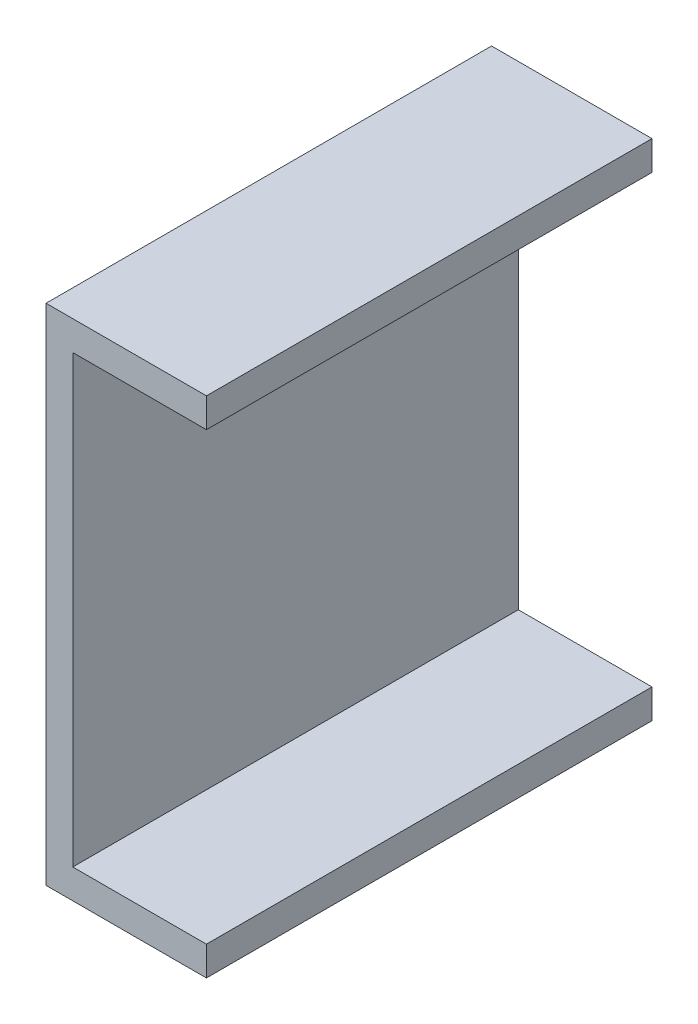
ISO-10303-21;
HEADER;
FILE_DESCRIPTION(('STEP AP214'),'2;1');
FILE_NAME('part.step','',(''),(''),'','','');
FILE_SCHEMA(('AUTOMOTIVE_DESIGN { 1 0 10303 214 1 1 1 1 }'));
ENDSEC;
DATA;
#1=APPLICATION_CONTEXT('core data for automotive mechanical design processes');
#2=APPLICATION_PROTOCOL_DEFINITION('international standard','automotive_design',2000,#1);
#3=PRODUCT_CONTEXT('',#1,'mechanical');
#4=PRODUCT('Part','Part','',(#3));
#5=PRODUCT_RELATED_PRODUCT_CATEGORY('part','',(#4));
#6=PRODUCT_DEFINITION_FORMATION('','',#4);
#7=PRODUCT_DEFINITION_CONTEXT('part definition',#1,'design');
#8=PRODUCT_DEFINITION('design','',#6,#7);
#9=PRODUCT_DEFINITION_SHAPE('','',#8);
#10=(LENGTH_UNIT() NAMED_UNIT(*) SI_UNIT(.MILLI.,.METRE.));
#11=(NAMED_UNIT(*) PLANE_ANGLE_UNIT() SI_UNIT($,.RADIAN.));
#12=(NAMED_UNIT(*) SI_UNIT($,.STERADIAN.) SOLID_ANGLE_UNIT());
#13=UNCERTAINTY_MEASURE_WITH_UNIT(LENGTH_MEASURE(1.E-05),#10,'distance_accuracy_value','');
#14=(GEOMETRIC_REPRESENTATION_CONTEXT(3) GLOBAL_UNCERTAINTY_ASSIGNED_CONTEXT((#13)) GLOBAL_UNIT_ASSIGNED_CONTEXT((#10,
#11,#12)) REPRESENTATION_CONTEXT('',''));
#15=CARTESIAN_POINT('',(0.,0.,0.));
#16=DIRECTION('',(0.,0.,1.));
#17=DIRECTION('',(1.,0.,0.));
#18=AXIS2_PLACEMENT_3D('',#15,#16,#17);
#19=CARTESIAN_POINT('',(101.695580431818,33.8978846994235,50.));
#20=DIRECTION('',(-1.,0.,0.));
#21=DIRECTION('',(0.,0.,1.));
#22=AXIS2_PLACEMENT_3D('',#19,#20,#21);
#23=PLANE('',#22);
#24=DIRECTION('',(0.,1.,0.));
#25=VECTOR('',#24,1.);
#26=CARTESIAN_POINT('',(101.695580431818,33.8978846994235,0.));
#27=LINE('',#26,#25);
#28=CARTESIAN_POINT('',(101.695580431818,30.6082089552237,0.));
#29=VERTEX_POINT('',#28);
#30=CARTESIAN_POINT('',(101.695580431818,33.8978846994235,0.));
#31=VERTEX_POINT('',#30);
#32=EDGE_CURVE('E146',#29,#31,#27,.T.);
#33=ORIENTED_EDGE('',*,*,#32,.T.);
#34=DIRECTION('',(0.,0.,-1.));
#35=VECTOR('',#34,1.);
#36=CARTESIAN_POINT('',(101.695580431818,33.8978846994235,50.));
#37=LINE('',#36,#35);
#38=CARTESIAN_POINT('',(101.695580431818,33.8978846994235,50.));
#39=VERTEX_POINT('',#38);
#40=EDGE_CURVE('E11',#39,#31,#37,.T.);
#41=ORIENTED_EDGE('',*,*,#40,.F.);
#42=DIRECTION('',(0.,1.,0.));
#43=VECTOR('',#42,1.);
#44=CARTESIAN_POINT('',(101.695580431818,33.8978846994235,50.));
#45=LINE('',#44,#43);
#46=CARTESIAN_POINT('',(101.695580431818,30.6082089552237,50.));
#47=VERTEX_POINT('',#46);
#48=EDGE_CURVE('E169',#47,#39,#45,.T.);
#49=ORIENTED_EDGE('',*,*,#48,.F.);
#50=DIRECTION('',(0.,0.,-1.));
#51=VECTOR('',#50,1.);
#52=CARTESIAN_POINT('',(101.695580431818,30.6082089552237,50.));
#53=LINE('',#52,#51);
#54=EDGE_CURVE('E142',#47,#29,#53,.T.);
#55=ORIENTED_EDGE('',*,*,#54,.T.);
#56=EDGE_LOOP('',(#33,#41,#49,#55));
#57=FACE_BOUND('',#56,.T.);
#58=ADVANCED_FACE('F45',(#57),#23,.F.);
#59=CARTESIAN_POINT('',(86.6955804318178,33.8978846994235,50.));
#60=DIRECTION('',(0.,-1.,0.));
#61=DIRECTION('',(1.,0.,0.));
#62=AXIS2_PLACEMENT_3D('',#59,#60,#61);
#63=PLANE('',#62);
#64=DIRECTION('',(-1.,0.,0.));
#65=VECTOR('',#64,1.);
#66=CARTESIAN_POINT('',(86.6955804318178,33.8978846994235,0.));
#67=LINE('',#66,#65);
#68=CARTESIAN_POINT('',(83.6955804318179,33.8978846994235,0.));
#69=VERTEX_POINT('',#68);
#70=EDGE_CURVE('E150',#31,#69,#67,.T.);
#71=ORIENTED_EDGE('',*,*,#70,.T.);
#72=DIRECTION('',(0.,0.,-1.));
#73=VECTOR('',#72,1.);
#74=CARTESIAN_POINT('',(83.6955804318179,33.8978846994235,50.));
#75=LINE('',#74,#73);
#76=CARTESIAN_POINT('',(83.6955804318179,33.8978846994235,50.));
#77=VERTEX_POINT('',#76);
#78=EDGE_CURVE('E54',#77,#69,#75,.T.);
#79=ORIENTED_EDGE('',*,*,#78,.F.);
#80=DIRECTION('',(-1.,0.,0.));
#81=VECTOR('',#80,1.);
#82=CARTESIAN_POINT('',(101.695580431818,33.8978846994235,50.));
#83=LINE('',#82,#81);
#84=EDGE_CURVE('E105',#39,#77,#83,.T.);
#85=ORIENTED_EDGE('',*,*,#84,.F.);
#86=ORIENTED_EDGE('',*,*,#40,.T.);
#87=EDGE_LOOP('',(#71,#79,#85,#86));
#88=FACE_BOUND('',#87,.T.);
#89=ADVANCED_FACE('F214',(#88),#63,.F.);
#90=CARTESIAN_POINT('',(83.6955804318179,33.8978846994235,50.));
#91=DIRECTION('',(1.,0.,0.));
#92=DIRECTION('',(0.,1.,0.));
#93=AXIS2_PLACEMENT_3D('',#90,#91,#92);
#94=PLANE('',#93);
#95=DIRECTION('',(0.,-1.,0.));
#96=VECTOR('',#95,1.);
#97=CARTESIAN_POINT('',(83.6955804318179,33.8978846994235,0.));
#98=LINE('',#97,#96);
#99=CARTESIAN_POINT('',(83.6955804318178,-22.6817910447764,0.));
#100=VERTEX_POINT('',#99);
#101=EDGE_CURVE('E153',#69,#100,#98,.T.);
#102=ORIENTED_EDGE('',*,*,#101,.T.);
#103=DIRECTION('',(0.,0.,-1.));
#104=VECTOR('',#103,1.);
#105=CARTESIAN_POINT('',(83.6955804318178,-22.6817910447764,50.));
#106=LINE('',#105,#104);
#107=CARTESIAN_POINT('',(83.6955804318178,-22.6817910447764,50.));
#108=VERTEX_POINT('',#107);
#109=EDGE_CURVE('E180',#108,#100,#106,.T.);
#110=ORIENTED_EDGE('',*,*,#109,.F.);
#111=DIRECTION('',(0.,-1.,0.));
#112=VECTOR('',#111,1.);
#113=CARTESIAN_POINT('',(83.6955804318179,33.8978846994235,50.));
#114=LINE('',#113,#112);
#115=EDGE_CURVE('E190',#77,#108,#114,.T.);
#116=ORIENTED_EDGE('',*,*,#115,.F.);
#117=ORIENTED_EDGE('',*,*,#78,.T.);
#118=EDGE_LOOP('',(#102,#110,#116,#117));
#119=FACE_BOUND('',#118,.T.);
#120=ADVANCED_FACE('F188',(#119),#94,.F.);
#121=CARTESIAN_POINT('',(101.695580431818,-22.6817910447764,50.));
#122=DIRECTION('',(0.,1.,0.));
#123=DIRECTION('',(0.,0.,1.));
#124=AXIS2_PLACEMENT_3D('',#121,#122,#123);
#125=PLANE('',#124);
#126=DIRECTION('',(1.,0.,0.));
#127=VECTOR('',#126,1.);
#128=CARTESIAN_POINT('',(101.695580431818,-22.6817910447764,0.));
#129=LINE('',#128,#127);
#130=CARTESIAN_POINT('',(101.695580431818,-22.6817910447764,0.));
#131=VERTEX_POINT('',#130);
#132=EDGE_CURVE('E157',#100,#131,#129,.T.);
#133=ORIENTED_EDGE('',*,*,#132,.T.);
#134=DIRECTION('',(0.,0.,-1.));
#135=VECTOR('',#134,1.);
#136=CARTESIAN_POINT('',(101.695580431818,-22.6817910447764,50.));
#137=LINE('',#136,#135);
#138=CARTESIAN_POINT('',(101.695580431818,-22.6817910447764,50.));
#139=VERTEX_POINT('',#138);
#140=EDGE_CURVE('E176',#139,#131,#137,.T.);
#141=ORIENTED_EDGE('',*,*,#140,.F.);
#142=DIRECTION('',(1.,0.,0.));
#143=VECTOR('',#142,1.);
#144=CARTESIAN_POINT('',(83.6955804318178,-22.6817910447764,50.));
#145=LINE('',#144,#143);
#146=EDGE_CURVE('E202',#108,#139,#145,.T.);
#147=ORIENTED_EDGE('',*,*,#146,.F.);
#148=ORIENTED_EDGE('',*,*,#109,.T.);
#149=EDGE_LOOP('',(#133,#141,#147,#148));
#150=FACE_BOUND('',#149,.T.);
#151=ADVANCED_FACE('F197',(#150),#125,.F.);
#152=CARTESIAN_POINT('',(101.695580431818,-22.6817910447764,50.));
#153=DIRECTION('',(-1.,0.,0.));
#154=DIRECTION('',(0.,0.,1.));
#155=AXIS2_PLACEMENT_3D('',#152,#153,#154);
#156=PLANE('',#155);
#157=DIRECTION('',(0.,1.,0.));
#158=VECTOR('',#157,1.);
#159=CARTESIAN_POINT('',(101.695580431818,-22.6817910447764,0.));
#160=LINE('',#159,#158);
#161=CARTESIAN_POINT('',(101.695580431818,-19.3917910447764,0.));
#162=VERTEX_POINT('',#161);
#163=EDGE_CURVE('E160',#131,#162,#160,.T.);
#164=ORIENTED_EDGE('',*,*,#163,.T.);
#165=DIRECTION('',(0.,0.,-1.));
#166=VECTOR('',#165,1.);
#167=CARTESIAN_POINT('',(101.695580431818,-19.3917910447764,50.));
#168=LINE('',#167,#166);
#169=CARTESIAN_POINT('',(101.695580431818,-19.3917910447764,50.));
#170=VERTEX_POINT('',#169);
#171=EDGE_CURVE('E135',#170,#162,#168,.T.);
#172=ORIENTED_EDGE('',*,*,#171,.F.);
#173=DIRECTION('',(0.,1.,0.));
#174=VECTOR('',#173,1.);
#175=CARTESIAN_POINT('',(101.695580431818,-22.6817910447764,50.));
#176=LINE('',#175,#174);
#177=EDGE_CURVE('E124',#139,#170,#176,.T.);
#178=ORIENTED_EDGE('',*,*,#177,.F.);
#179=ORIENTED_EDGE('',*,*,#140,.T.);
#180=EDGE_LOOP('',(#164,#172,#178,#179));
#181=FACE_BOUND('',#180,.T.);
#182=ADVANCED_FACE('F200',(#181),#156,.F.);
#183=CARTESIAN_POINT('',(101.695580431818,-19.3917910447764,50.));
#184=DIRECTION('',(0.,-1.,0.));
#185=DIRECTION('',(1.,0.,0.));
#186=AXIS2_PLACEMENT_3D('',#183,#184,#185);
#187=PLANE('',#186);
#188=DIRECTION('',(-1.,0.,0.));
#189=VECTOR('',#188,1.);
#190=CARTESIAN_POINT('',(101.695580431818,-19.3917910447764,0.));
#191=LINE('',#190,#189);
#192=CARTESIAN_POINT('',(86.6955804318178,-19.3917910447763,0.));
#193=VERTEX_POINT('',#192);
#194=EDGE_CURVE('E133',#162,#193,#191,.T.);
#195=ORIENTED_EDGE('',*,*,#194,.T.);
#196=DIRECTION('',(0.,0.,-1.));
#197=VECTOR('',#196,1.);
#198=CARTESIAN_POINT('',(86.6955804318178,-19.3917910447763,50.));
#199=LINE('',#198,#197);
#200=CARTESIAN_POINT('',(86.6955804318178,-19.3917910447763,50.));
#201=VERTEX_POINT('',#200);
#202=EDGE_CURVE('E130',#201,#193,#199,.T.);
#203=ORIENTED_EDGE('',*,*,#202,.F.);
#204=DIRECTION('',(-1.,0.,0.));
#205=VECTOR('',#204,1.);
#206=CARTESIAN_POINT('',(101.695580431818,-19.3917910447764,50.));
#207=LINE('',#206,#205);
#208=EDGE_CURVE('E118',#170,#201,#207,.T.);
#209=ORIENTED_EDGE('',*,*,#208,.F.);
#210=ORIENTED_EDGE('',*,*,#171,.T.);
#211=EDGE_LOOP('',(#195,#203,#209,#210));
#212=FACE_BOUND('',#211,.T.);
#213=ADVANCED_FACE('F131',(#212),#187,.F.);
#214=CARTESIAN_POINT('',(86.6955804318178,30.6082089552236,50.));
#215=DIRECTION('',(-1.,0.,0.));
#216=DIRECTION('',(0.,-1.,0.));
#217=AXIS2_PLACEMENT_3D('',#214,#215,#216);
#218=PLANE('',#217);
#219=DIRECTION('',(0.,1.,0.));
#220=VECTOR('',#219,1.);
#221=CARTESIAN_POINT('',(86.6955804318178,30.6082089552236,0.));
#222=LINE('',#221,#220);
#223=CARTESIAN_POINT('',(86.6955804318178,30.6082089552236,0.));
#224=VERTEX_POINT('',#223);
#225=EDGE_CURVE('E91',#193,#224,#222,.T.);
#226=ORIENTED_EDGE('',*,*,#225,.T.);
#227=DIRECTION('',(0.,0.,-1.));
#228=VECTOR('',#227,1.);
#229=CARTESIAN_POINT('',(86.6955804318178,30.6082089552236,50.));
#230=LINE('',#229,#228);
#231=CARTESIAN_POINT('',(86.6955804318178,30.6082089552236,50.));
#232=VERTEX_POINT('',#231);
#233=EDGE_CURVE('E136',#232,#224,#230,.T.);
#234=ORIENTED_EDGE('',*,*,#233,.F.);
#235=DIRECTION('',(0.,1.,0.));
#236=VECTOR('',#235,1.);
#237=CARTESIAN_POINT('',(86.6955804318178,30.6082089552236,50.));
#238=LINE('',#237,#236);
#239=EDGE_CURVE('E122',#201,#232,#238,.T.);
#240=ORIENTED_EDGE('',*,*,#239,.F.);
#241=ORIENTED_EDGE('',*,*,#202,.T.);
#242=EDGE_LOOP('',(#226,#234,#240,#241));
#243=FACE_BOUND('',#242,.T.);
#244=ADVANCED_FACE('F138',(#243),#218,.F.);
#245=CARTESIAN_POINT('',(101.695580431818,30.6082089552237,50.));
#246=DIRECTION('',(0.,1.,0.));
#247=DIRECTION('',(-1.,0.,0.));
#248=AXIS2_PLACEMENT_3D('',#245,#246,#247);
#249=PLANE('',#248);
#250=DIRECTION('',(1.,0.,0.));
#251=VECTOR('',#250,1.);
#252=CARTESIAN_POINT('',(101.695580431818,30.6082089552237,0.));
#253=LINE('',#252,#251);
#254=EDGE_CURVE('E97',#224,#29,#253,.T.);
#255=ORIENTED_EDGE('',*,*,#254,.T.);
#256=ORIENTED_EDGE('',*,*,#54,.F.);
#257=DIRECTION('',(1.,0.,0.));
#258=VECTOR('',#257,1.);
#259=CARTESIAN_POINT('',(101.695580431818,30.6082089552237,50.));
#260=LINE('',#259,#258);
#261=EDGE_CURVE('E62',#232,#47,#260,.T.);
#262=ORIENTED_EDGE('',*,*,#261,.F.);
#263=ORIENTED_EDGE('',*,*,#233,.T.);
#264=EDGE_LOOP('',(#255,#256,#262,#263));
#265=FACE_BOUND('',#264,.T.);
#266=ADVANCED_FACE('F230',(#265),#249,.F.);
#267=CARTESIAN_POINT('',(0.,0.,50.));
#268=DIRECTION('',(0.,0.,-1.));
#269=DIRECTION('',(-1.,0.,0.));
#270=AXIS2_PLACEMENT_3D('',#267,#268,#269);
#271=PLANE('',#270);
#272=ORIENTED_EDGE('',*,*,#48,.T.);
#273=ORIENTED_EDGE('',*,*,#84,.T.);
#274=ORIENTED_EDGE('',*,*,#115,.T.);
#275=ORIENTED_EDGE('',*,*,#146,.T.);
#276=ORIENTED_EDGE('',*,*,#177,.T.);
#277=ORIENTED_EDGE('',*,*,#208,.T.);
#278=ORIENTED_EDGE('',*,*,#239,.T.);
#279=ORIENTED_EDGE('',*,*,#261,.T.);
#280=EDGE_LOOP('',(#272,#273,#274,#275,#276,#277,#278,#279));
#281=FACE_BOUND('',#280,.T.);
#282=ADVANCED_FACE('F120',(#281),#271,.F.);
#283=CARTESIAN_POINT('',(0.,0.,0.));
#284=DIRECTION('',(0.,0.,-1.));
#285=DIRECTION('',(-1.,0.,0.));
#286=AXIS2_PLACEMENT_3D('',#283,#284,#285);
#287=PLANE('',#286);
#288=ORIENTED_EDGE('',*,*,#32,.F.);
#289=ORIENTED_EDGE('',*,*,#254,.F.);
#290=ORIENTED_EDGE('',*,*,#225,.F.);
#291=ORIENTED_EDGE('',*,*,#194,.F.);
#292=ORIENTED_EDGE('',*,*,#163,.F.);
#293=ORIENTED_EDGE('',*,*,#132,.F.);
#294=ORIENTED_EDGE('',*,*,#101,.F.);
#295=ORIENTED_EDGE('',*,*,#70,.F.);
#296=EDGE_LOOP('',(#288,#289,#290,#291,#292,#293,#294,#295));
#297=FACE_BOUND('',#296,.T.);
#298=ADVANCED_FACE('F193',(#297),#287,.T.);
#299=CLOSED_SHELL('',(#58,#89,#120,#151,#182,#213,#244,#266,#282,#298));
#300=MANIFOLD_SOLID_BREP('B2',#299);
#301=ADVANCED_BREP_SHAPE_REPRESENTATION('',(#18,#300),#14);
#302=SHAPE_DEFINITION_REPRESENTATION(#9,#301);
ENDSEC;
END-ISO-10303-21;
